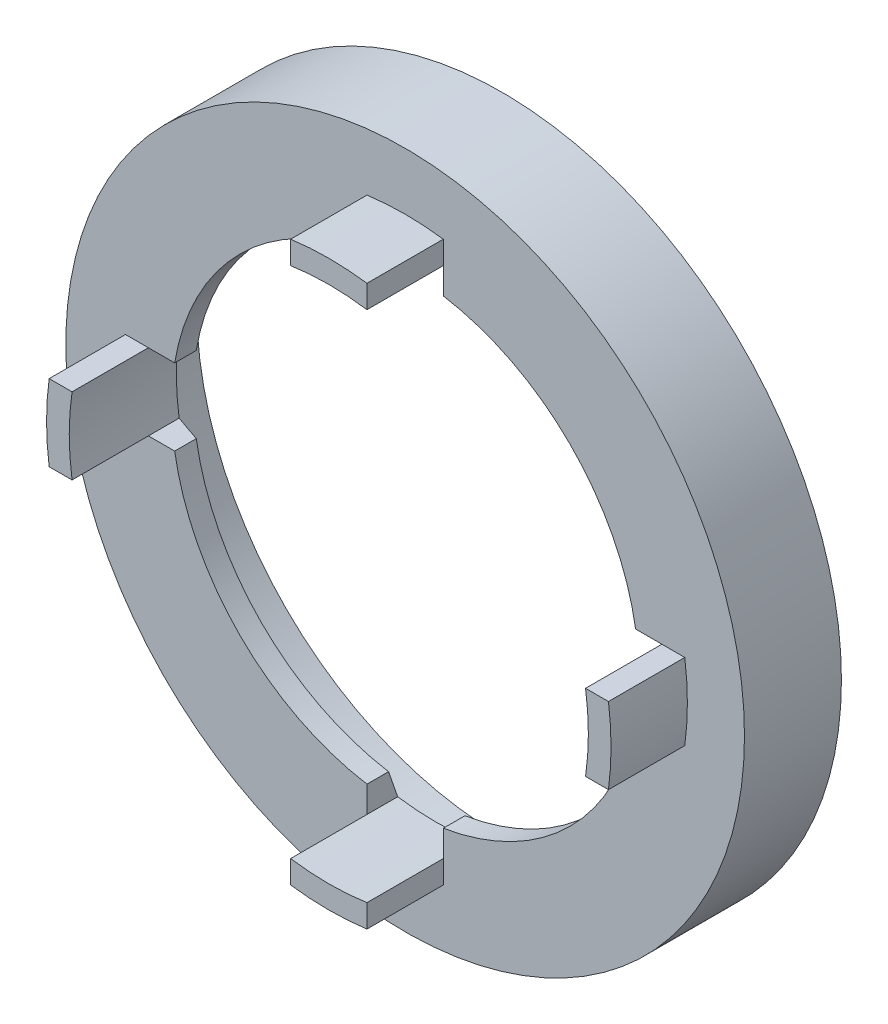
from build123d import *

# Parameters (mm, degrees)
SKETCH1_R           = 22.225
BOSS_EXTRUDE1_DEPTH = 6.35
CUT_EXTRUDE1_REACH  = 34.066
SKETCH2_R           = 15.3
BOSS_EXTRUDE2_DEPTH = 5
CUT_EXTRUDE2_DEPTH  = 33.065928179
CIRPATTERN1_COUNT   = 4


with BuildPart() as part:
    # Sketch1 → Boss-Extrude1 (new body)
    with BuildSketch(Plane.XY):
        Circle(SKETCH1_R)
    extrude(amount=BOSS_EXTRUDE1_DEPTH)

    # Sketch2 → Cut-Extrude1 (cut, up to next)
    with BuildSketch(Plane.XY.offset(6.35), mode=Mode.PRIVATE) as cut_extrude1_sk1:
        Circle(SKETCH2_R)
    cut_extrude1_tool1 = extrude(cut_extrude1_sk1.sketch, amount=-CUT_EXTRUDE1_REACH, mode=Mode.PRIVATE) & part.part
    add(cut_extrude1_tool1.solids().sort_by_distance((0, 0, 6.35))[0], mode=Mode.SUBTRACT)

    # Sketch3 → Cut-Revolve1 (revolve, cut)
    with BuildSketch(Plane(origin=(0, 0, 0), x_dir=(1, 0, 0), z_dir=(0, 1, 0)), mode=Mode.PRIVATE) as cut_revolve1_sk:
        Polygon((-20, 0), (-15, 0), (-15, -5.041390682), (-17, -4.338609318), (-20, -4.338609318), align=None)
    revolve(cut_revolve1_sk.sketch.rotate(Axis((0, 0, -1.424421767), (0, 0, -1)), 180), axis=Axis((0, 0, -1.424421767), (0, 0, -1)), mode=Mode.SUBTRACT)

    # Sketch7 → Boss-Extrude2 (add)
    with BuildSketch(Plane.XY.offset(6.35)):
        with BuildLine():
            Line((-16.815171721, 2.5), (-18.315171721, 2.5))
            ThreePointArc((-18.315171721, 2.5), (-18.485007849, 0), (-18.315171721, -2.5))
            Line((-18.315171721, -2.5), (-16.815171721, -2.5))
            ThreePointArc((-16.815171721, -2.5), (-17, 0), (-16.815171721, 2.5))
        make_face()
    boss_extrude2 = extrude(amount=BOSS_EXTRUDE2_DEPTH)

    # Sketch8 → Cut-Extrude2 (cut, through all)
    with BuildSketch(Plane.XY.offset(6.35)):
        with BuildLine():
            Line((-16.815171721, 2.5), (-15.094369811, 2.5))
            Line((-15.094369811, 2.5), (-15.094369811, -2.5))
            Line((-15.094369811, -2.5), (-16.815171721, -2.5))
            ThreePointArc((-16.815171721, -2.5), (-17, 0), (-16.815171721, 2.5))
        make_face()
    cut_extrude2 = extrude(amount=-CUT_EXTRUDE2_DEPTH, mode=Mode.SUBTRACT)

    # CirPattern1: Boss-Extrude2, Cut-Extrude2 ×4 about axis
    cirpattern1_axis = Axis((0, 0, 0), (0, 0, 1))
    add([boss_extrude2.rotate(cirpattern1_axis, i * 360 / CIRPATTERN1_COUNT) for i in range(1, CIRPATTERN1_COUNT)])
    add([cut_extrude2.rotate(cirpattern1_axis, i * 360 / CIRPATTERN1_COUNT) for i in range(1, CIRPATTERN1_COUNT)], mode=Mode.SUBTRACT)


solid = part.part
